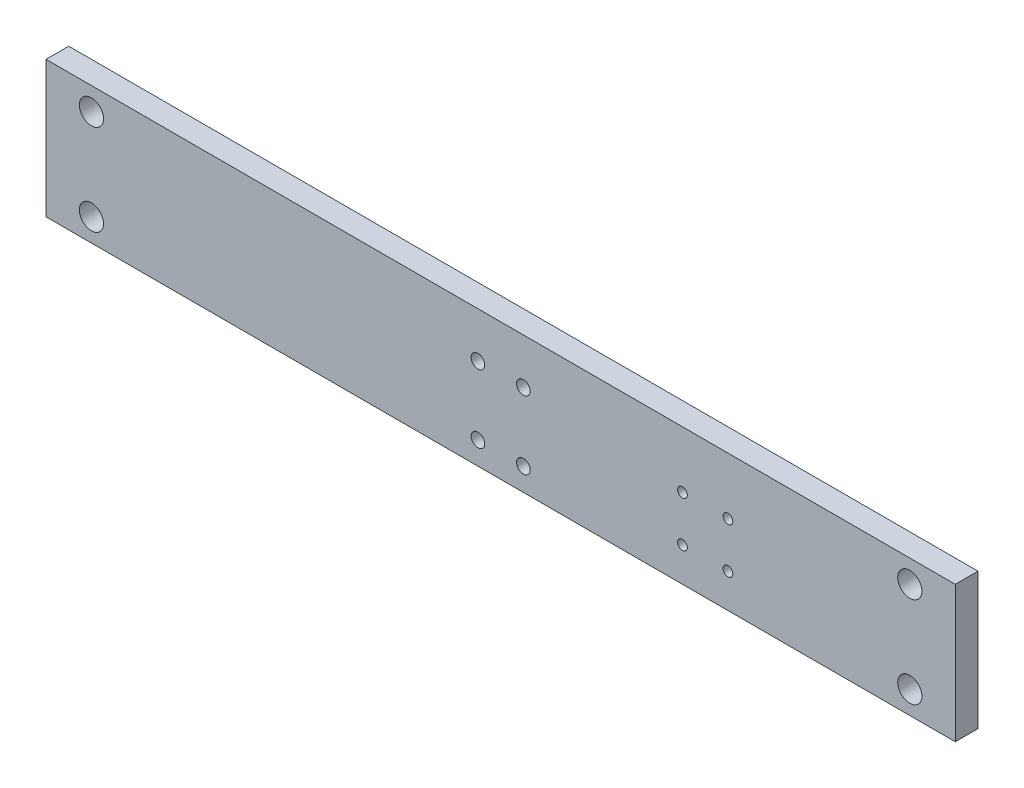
ISO-10303-21;
HEADER;
FILE_DESCRIPTION(('STEP AP214'),'2;1');
FILE_NAME('part.step','',(''),(''),'','','');
FILE_SCHEMA(('AUTOMOTIVE_DESIGN { 1 0 10303 214 1 1 1 1 }'));
ENDSEC;
DATA;
#1=APPLICATION_CONTEXT('core data for automotive mechanical design processes');
#2=APPLICATION_PROTOCOL_DEFINITION('international standard','automotive_design',2000,#1);
#3=PRODUCT_CONTEXT('',#1,'mechanical');
#4=PRODUCT('Part','Part','',(#3));
#5=PRODUCT_RELATED_PRODUCT_CATEGORY('part','',(#4));
#6=PRODUCT_DEFINITION_FORMATION('','',#4);
#7=PRODUCT_DEFINITION_CONTEXT('part definition',#1,'design');
#8=PRODUCT_DEFINITION('design','',#6,#7);
#9=PRODUCT_DEFINITION_SHAPE('','',#8);
#10=(LENGTH_UNIT() NAMED_UNIT(*) SI_UNIT(.MILLI.,.METRE.));
#11=(NAMED_UNIT(*) PLANE_ANGLE_UNIT() SI_UNIT($,.RADIAN.));
#12=(NAMED_UNIT(*) SI_UNIT($,.STERADIAN.) SOLID_ANGLE_UNIT());
#13=UNCERTAINTY_MEASURE_WITH_UNIT(LENGTH_MEASURE(1.E-05),#10,'distance_accuracy_value','');
#14=(GEOMETRIC_REPRESENTATION_CONTEXT(3) GLOBAL_UNCERTAINTY_ASSIGNED_CONTEXT((#13)) GLOBAL_UNIT_ASSIGNED_CONTEXT((#10,
#11,#12)) REPRESENTATION_CONTEXT('',''));
#15=CARTESIAN_POINT('',(0.,0.,0.));
#16=DIRECTION('',(0.,0.,1.));
#17=DIRECTION('',(1.,0.,0.));
#18=AXIS2_PLACEMENT_3D('',#15,#16,#17);
#19=CARTESIAN_POINT('',(-127.,-19.05,6.35));
#20=DIRECTION('',(0.,0.,1.));
#21=DIRECTION('',(1.,0.,0.));
#22=AXIS2_PLACEMENT_3D('',#19,#20,#21);
#23=PLANE('',#22);
#24=CARTESIAN_POINT('',(50.8,-9.52500000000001,6.34999999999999));
#25=DIRECTION('',(0.,0.,-1.));
#26=DIRECTION('',(-1.,0.,0.));
#27=AXIS2_PLACEMENT_3D('',#24,#25,#26);
#28=CIRCLE('',#27,1.35254999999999);
#29=CARTESIAN_POINT('',(49.44745,-9.52500000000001,6.34999999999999));
#30=VERTEX_POINT('',#29);
#31=EDGE_CURVE('E135',#30,#30,#28,.T.);
#32=ORIENTED_EDGE('',*,*,#31,.T.);
#33=EDGE_LOOP('',(#32));
#34=FACE_BOUND('',#33,.T.);
#35=CARTESIAN_POINT('',(63.5,3.17499999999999,6.34999999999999));
#36=DIRECTION('',(0.,0.,-1.));
#37=DIRECTION('',(-1.,0.,0.));
#38=AXIS2_PLACEMENT_3D('',#35,#36,#37);
#39=CIRCLE('',#38,1.35254999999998);
#40=CARTESIAN_POINT('',(62.14745,3.17499999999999,6.34999999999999));
#41=VERTEX_POINT('',#40);
#42=EDGE_CURVE('E147',#41,#41,#39,.T.);
#43=ORIENTED_EDGE('',*,*,#42,.T.);
#44=EDGE_LOOP('',(#43));
#45=FACE_BOUND('',#44,.T.);
#46=CARTESIAN_POINT('',(-114.3,12.7,6.35));
#47=DIRECTION('',(0.,0.,1.));
#48=DIRECTION('',(1.,0.,0.));
#49=AXIS2_PLACEMENT_3D('',#46,#47,#48);
#50=CIRCLE('',#49,3.37819999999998);
#51=CARTESIAN_POINT('',(-110.9218,12.7,6.35));
#52=VERTEX_POINT('',#51);
#53=EDGE_CURVE('E153',#52,#52,#50,.T.);
#54=ORIENTED_EDGE('',*,*,#53,.F.);
#55=EDGE_LOOP('',(#54));
#56=FACE_BOUND('',#55,.T.);
#57=CARTESIAN_POINT('',(-114.3,-12.7,6.35));
#58=DIRECTION('',(0.,0.,1.));
#59=DIRECTION('',(1.,0.,0.));
#60=AXIS2_PLACEMENT_3D('',#57,#58,#59);
#61=CIRCLE('',#60,3.37819999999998);
#62=CARTESIAN_POINT('',(-110.9218,-12.7,6.35));
#63=VERTEX_POINT('',#62);
#64=EDGE_CURVE('E159',#63,#63,#61,.T.);
#65=ORIENTED_EDGE('',*,*,#64,.F.);
#66=EDGE_LOOP('',(#65));
#67=FACE_BOUND('',#66,.T.);
#68=CARTESIAN_POINT('',(114.3,-12.7,6.35));
#69=DIRECTION('',(0.,0.,1.));
#70=DIRECTION('',(1.,0.,0.));
#71=AXIS2_PLACEMENT_3D('',#68,#69,#70);
#72=CIRCLE('',#71,3.37819999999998);
#73=CARTESIAN_POINT('',(117.6782,-12.7,6.35));
#74=VERTEX_POINT('',#73);
#75=EDGE_CURVE('E165',#74,#74,#72,.T.);
#76=ORIENTED_EDGE('',*,*,#75,.F.);
#77=EDGE_LOOP('',(#76));
#78=FACE_BOUND('',#77,.T.);
#79=CARTESIAN_POINT('',(114.3,12.7,6.35));
#80=DIRECTION('',(0.,0.,1.));
#81=DIRECTION('',(1.,0.,0.));
#82=AXIS2_PLACEMENT_3D('',#79,#80,#81);
#83=CIRCLE('',#82,3.37819999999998);
#84=CARTESIAN_POINT('',(117.6782,12.7,6.35));
#85=VERTEX_POINT('',#84);
#86=EDGE_CURVE('E171',#85,#85,#83,.T.);
#87=ORIENTED_EDGE('',*,*,#86,.F.);
#88=EDGE_LOOP('',(#87));
#89=FACE_BOUND('',#88,.T.);
#90=CARTESIAN_POINT('',(6.35,-12.7,6.35));
#91=DIRECTION('',(0.,0.,1.));
#92=DIRECTION('',(1.,0.,0.));
#93=AXIS2_PLACEMENT_3D('',#90,#91,#92);
#94=CIRCLE('',#93,1.89864999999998);
#95=CARTESIAN_POINT('',(8.24864999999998,-12.7,6.35));
#96=VERTEX_POINT('',#95);
#97=EDGE_CURVE('E180',#96,#96,#94,.T.);
#98=ORIENTED_EDGE('',*,*,#97,.F.);
#99=EDGE_LOOP('',(#98));
#100=FACE_BOUND('',#99,.T.);
#101=CARTESIAN_POINT('',(-6.35,-12.7,6.35));
#102=DIRECTION('',(0.,0.,1.));
#103=DIRECTION('',(1.,0.,0.));
#104=AXIS2_PLACEMENT_3D('',#101,#102,#103);
#105=CIRCLE('',#104,1.89864999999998);
#106=CARTESIAN_POINT('',(-4.45135000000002,-12.7,6.35));
#107=VERTEX_POINT('',#106);
#108=EDGE_CURVE('E186',#107,#107,#105,.T.);
#109=ORIENTED_EDGE('',*,*,#108,.F.);
#110=EDGE_LOOP('',(#109));
#111=FACE_BOUND('',#110,.T.);
#112=CARTESIAN_POINT('',(6.35,6.35,6.35));
#113=DIRECTION('',(0.,0.,1.));
#114=DIRECTION('',(1.,0.,0.));
#115=AXIS2_PLACEMENT_3D('',#112,#113,#114);
#116=CIRCLE('',#115,1.89864999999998);
#117=CARTESIAN_POINT('',(8.24864999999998,6.35,6.35));
#118=VERTEX_POINT('',#117);
#119=EDGE_CURVE('E192',#118,#118,#116,.T.);
#120=ORIENTED_EDGE('',*,*,#119,.F.);
#121=EDGE_LOOP('',(#120));
#122=FACE_BOUND('',#121,.T.);
#123=CARTESIAN_POINT('',(-6.35,6.35,6.35));
#124=DIRECTION('',(0.,0.,1.));
#125=DIRECTION('',(1.,0.,0.));
#126=AXIS2_PLACEMENT_3D('',#123,#124,#125);
#127=CIRCLE('',#126,1.89864999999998);
#128=CARTESIAN_POINT('',(-4.45135000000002,6.35,6.35));
#129=VERTEX_POINT('',#128);
#130=EDGE_CURVE('E98',#129,#129,#127,.T.);
#131=ORIENTED_EDGE('',*,*,#130,.F.);
#132=EDGE_LOOP('',(#131));
#133=FACE_BOUND('',#132,.T.);
#134=DIRECTION('',(0.,-1.,0.));
#135=VECTOR('',#134,1.);
#136=CARTESIAN_POINT('',(-127.,19.05,6.35));
#137=LINE('',#136,#135);
#138=CARTESIAN_POINT('',(-127.,19.05,6.35));
#139=VERTEX_POINT('',#138);
#140=CARTESIAN_POINT('',(-127.,-19.05,6.35));
#141=VERTEX_POINT('',#140);
#142=EDGE_CURVE('E108',#139,#141,#137,.T.);
#143=ORIENTED_EDGE('',*,*,#142,.T.);
#144=DIRECTION('',(1.,0.,0.));
#145=VECTOR('',#144,1.);
#146=CARTESIAN_POINT('',(-127.,-19.05,6.35));
#147=LINE('',#146,#145);
#148=CARTESIAN_POINT('',(127.,-19.05,6.35));
#149=VERTEX_POINT('',#148);
#150=EDGE_CURVE('E93',#141,#149,#147,.T.);
#151=ORIENTED_EDGE('',*,*,#150,.T.);
#152=DIRECTION('',(0.,1.,0.));
#153=VECTOR('',#152,1.);
#154=CARTESIAN_POINT('',(127.,19.05,6.35));
#155=LINE('',#154,#153);
#156=CARTESIAN_POINT('',(127.,19.05,6.35));
#157=VERTEX_POINT('',#156);
#158=EDGE_CURVE('E60',#149,#157,#155,.T.);
#159=ORIENTED_EDGE('',*,*,#158,.T.);
#160=DIRECTION('',(-1.,0.,0.));
#161=VECTOR('',#160,1.);
#162=CARTESIAN_POINT('',(-127.,19.05,6.35));
#163=LINE('',#162,#161);
#164=EDGE_CURVE('E55',#157,#139,#163,.T.);
#165=ORIENTED_EDGE('',*,*,#164,.T.);
#166=EDGE_LOOP('',(#143,#151,#159,#165));
#167=FACE_BOUND('',#166,.T.);
#168=CARTESIAN_POINT('',(63.5,-9.52500000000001,6.34999999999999));
#169=DIRECTION('',(0.,0.,-1.));
#170=DIRECTION('',(-1.,0.,0.));
#171=AXIS2_PLACEMENT_3D('',#168,#169,#170);
#172=CIRCLE('',#171,1.35254999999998);
#173=CARTESIAN_POINT('',(62.14745,-9.52500000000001,6.34999999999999));
#174=VERTEX_POINT('',#173);
#175=EDGE_CURVE('E127',#174,#174,#172,.T.);
#176=ORIENTED_EDGE('',*,*,#175,.T.);
#177=EDGE_LOOP('',(#176));
#178=FACE_BOUND('',#177,.T.);
#179=CARTESIAN_POINT('',(50.8,3.17499999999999,6.34999999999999));
#180=DIRECTION('',(0.,0.,-1.));
#181=DIRECTION('',(-1.,0.,0.));
#182=AXIS2_PLACEMENT_3D('',#179,#180,#181);
#183=CIRCLE('',#182,1.35254999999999);
#184=CARTESIAN_POINT('',(49.44745,3.17499999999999,6.34999999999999));
#185=VERTEX_POINT('',#184);
#186=EDGE_CURVE('E130',#185,#185,#183,.T.);
#187=ORIENTED_EDGE('',*,*,#186,.T.);
#188=EDGE_LOOP('',(#187));
#189=FACE_BOUND('',#188,.T.);
#190=ADVANCED_FACE('F40',(#34,#45,#56,#67,#78,#89,#100,#111,#122,#133,#167,#178,#189),#23,.T.);
#191=CARTESIAN_POINT('',(-127.,19.05,6.35));
#192=DIRECTION('',(1.,0.,0.));
#193=DIRECTION('',(0.,1.,0.));
#194=AXIS2_PLACEMENT_3D('',#191,#192,#193);
#195=PLANE('',#194);
#196=DIRECTION('',(0.,-1.,0.));
#197=VECTOR('',#196,1.);
#198=CARTESIAN_POINT('',(-127.,19.05,0.));
#199=LINE('',#198,#197);
#200=CARTESIAN_POINT('',(-127.,19.05,0.));
#201=VERTEX_POINT('',#200);
#202=CARTESIAN_POINT('',(-127.,-19.05,0.));
#203=VERTEX_POINT('',#202);
#204=EDGE_CURVE('E85',#201,#203,#199,.T.);
#205=ORIENTED_EDGE('',*,*,#204,.T.);
#206=DIRECTION('',(0.,0.,-1.));
#207=VECTOR('',#206,1.);
#208=CARTESIAN_POINT('',(-127.,-19.05,6.35));
#209=LINE('',#208,#207);
#210=EDGE_CURVE('E13',#141,#203,#209,.T.);
#211=ORIENTED_EDGE('',*,*,#210,.F.);
#212=ORIENTED_EDGE('',*,*,#142,.F.);
#213=DIRECTION('',(0.,0.,-1.));
#214=VECTOR('',#213,1.);
#215=CARTESIAN_POINT('',(-127.,19.05,6.35));
#216=LINE('',#215,#214);
#217=EDGE_CURVE('E97',#139,#201,#216,.T.);
#218=ORIENTED_EDGE('',*,*,#217,.T.);
#219=EDGE_LOOP('',(#205,#211,#212,#218));
#220=FACE_BOUND('',#219,.T.);
#221=ADVANCED_FACE('F42',(#220),#195,.F.);
#222=CARTESIAN_POINT('',(-127.,-19.05,6.35));
#223=DIRECTION('',(0.,1.,0.));
#224=DIRECTION('',(0.,0.,1.));
#225=AXIS2_PLACEMENT_3D('',#222,#223,#224);
#226=PLANE('',#225);
#227=DIRECTION('',(1.,0.,0.));
#228=VECTOR('',#227,1.);
#229=CARTESIAN_POINT('',(-127.,-19.05,0.));
#230=LINE('',#229,#228);
#231=CARTESIAN_POINT('',(127.,-19.05,0.));
#232=VERTEX_POINT('',#231);
#233=EDGE_CURVE('E81',#203,#232,#230,.T.);
#234=ORIENTED_EDGE('',*,*,#233,.T.);
#235=DIRECTION('',(0.,0.,-1.));
#236=VECTOR('',#235,1.);
#237=CARTESIAN_POINT('',(127.,-19.05,6.35));
#238=LINE('',#237,#236);
#239=EDGE_CURVE('E48',#149,#232,#238,.T.);
#240=ORIENTED_EDGE('',*,*,#239,.F.);
#241=ORIENTED_EDGE('',*,*,#150,.F.);
#242=ORIENTED_EDGE('',*,*,#210,.T.);
#243=EDGE_LOOP('',(#234,#240,#241,#242));
#244=FACE_BOUND('',#243,.T.);
#245=ADVANCED_FACE('F92',(#244),#226,.F.);
#246=CARTESIAN_POINT('',(127.,19.05,6.35));
#247=DIRECTION('',(-1.,0.,0.));
#248=DIRECTION('',(0.,0.,1.));
#249=AXIS2_PLACEMENT_3D('',#246,#247,#248);
#250=PLANE('',#249);
#251=DIRECTION('',(0.,1.,0.));
#252=VECTOR('',#251,1.);
#253=CARTESIAN_POINT('',(127.,19.05,0.));
#254=LINE('',#253,#252);
#255=CARTESIAN_POINT('',(127.,19.05,0.));
#256=VERTEX_POINT('',#255);
#257=EDGE_CURVE('E86',#232,#256,#254,.T.);
#258=ORIENTED_EDGE('',*,*,#257,.T.);
#259=DIRECTION('',(0.,0.,-1.));
#260=VECTOR('',#259,1.);
#261=CARTESIAN_POINT('',(127.,19.05,6.35));
#262=LINE('',#261,#260);
#263=EDGE_CURVE('E114',#157,#256,#262,.T.);
#264=ORIENTED_EDGE('',*,*,#263,.F.);
#265=ORIENTED_EDGE('',*,*,#158,.F.);
#266=ORIENTED_EDGE('',*,*,#239,.T.);
#267=EDGE_LOOP('',(#258,#264,#265,#266));
#268=FACE_BOUND('',#267,.T.);
#269=ADVANCED_FACE('F117',(#268),#250,.F.);
#270=CARTESIAN_POINT('',(-127.,19.05,6.35));
#271=DIRECTION('',(0.,-1.,0.));
#272=DIRECTION('',(0.,0.,-1.));
#273=AXIS2_PLACEMENT_3D('',#270,#271,#272);
#274=PLANE('',#273);
#275=DIRECTION('',(-1.,0.,0.));
#276=VECTOR('',#275,1.);
#277=CARTESIAN_POINT('',(-127.,19.05,0.));
#278=LINE('',#277,#276);
#279=EDGE_CURVE('E106',#256,#201,#278,.T.);
#280=ORIENTED_EDGE('',*,*,#279,.T.);
#281=ORIENTED_EDGE('',*,*,#217,.F.);
#282=ORIENTED_EDGE('',*,*,#164,.F.);
#283=ORIENTED_EDGE('',*,*,#263,.T.);
#284=EDGE_LOOP('',(#280,#281,#282,#283));
#285=FACE_BOUND('',#284,.T.);
#286=ADVANCED_FACE('F119',(#285),#274,.F.);
#287=CARTESIAN_POINT('',(-127.,-19.05,0.));
#288=DIRECTION('',(0.,0.,1.));
#289=DIRECTION('',(1.,0.,0.));
#290=AXIS2_PLACEMENT_3D('',#287,#288,#289);
#291=PLANE('',#290);
#292=CARTESIAN_POINT('',(50.8,3.17499999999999,0.));
#293=DIRECTION('',(0.,0.,-1.));
#294=DIRECTION('',(-1.,0.,0.));
#295=AXIS2_PLACEMENT_3D('',#292,#293,#294);
#296=CIRCLE('',#295,1.35254999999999);
#297=CARTESIAN_POINT('',(49.44745,3.17499999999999,0.));
#298=VERTEX_POINT('',#297);
#299=EDGE_CURVE('E132',#298,#298,#296,.T.);
#300=ORIENTED_EDGE('',*,*,#299,.F.);
#301=EDGE_LOOP('',(#300));
#302=FACE_BOUND('',#301,.T.);
#303=CARTESIAN_POINT('',(50.8,-9.52500000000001,0.));
#304=DIRECTION('',(0.,0.,-1.));
#305=DIRECTION('',(-1.,0.,0.));
#306=AXIS2_PLACEMENT_3D('',#303,#304,#305);
#307=CIRCLE('',#306,1.35254999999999);
#308=CARTESIAN_POINT('',(49.44745,-9.52500000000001,0.));
#309=VERTEX_POINT('',#308);
#310=EDGE_CURVE('E140',#309,#309,#307,.T.);
#311=ORIENTED_EDGE('',*,*,#310,.F.);
#312=EDGE_LOOP('',(#311));
#313=FACE_BOUND('',#312,.T.);
#314=CARTESIAN_POINT('',(63.5,-9.52500000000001,0.));
#315=DIRECTION('',(0.,0.,-1.));
#316=DIRECTION('',(-1.,0.,0.));
#317=AXIS2_PLACEMENT_3D('',#314,#315,#316);
#318=CIRCLE('',#317,1.35254999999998);
#319=CARTESIAN_POINT('',(62.14745,-9.52500000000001,0.));
#320=VERTEX_POINT('',#319);
#321=EDGE_CURVE('E144',#320,#320,#318,.T.);
#322=ORIENTED_EDGE('',*,*,#321,.F.);
#323=EDGE_LOOP('',(#322));
#324=FACE_BOUND('',#323,.T.);
#325=CARTESIAN_POINT('',(63.5,3.17499999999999,0.));
#326=DIRECTION('',(0.,0.,-1.));
#327=DIRECTION('',(-1.,0.,0.));
#328=AXIS2_PLACEMENT_3D('',#325,#326,#327);
#329=CIRCLE('',#328,1.35254999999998);
#330=CARTESIAN_POINT('',(62.14745,3.17499999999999,0.));
#331=VERTEX_POINT('',#330);
#332=EDGE_CURVE('E150',#331,#331,#329,.T.);
#333=ORIENTED_EDGE('',*,*,#332,.F.);
#334=EDGE_LOOP('',(#333));
#335=FACE_BOUND('',#334,.T.);
#336=CARTESIAN_POINT('',(-114.3,12.7,0.));
#337=DIRECTION('',(0.,0.,1.));
#338=DIRECTION('',(1.,0.,0.));
#339=AXIS2_PLACEMENT_3D('',#336,#337,#338);
#340=CIRCLE('',#339,3.3782);
#341=CARTESIAN_POINT('',(-110.9218,12.7,0.));
#342=VERTEX_POINT('',#341);
#343=EDGE_CURVE('E156',#342,#342,#340,.T.);
#344=ORIENTED_EDGE('',*,*,#343,.T.);
#345=EDGE_LOOP('',(#344));
#346=FACE_BOUND('',#345,.T.);
#347=CARTESIAN_POINT('',(-114.3,-12.7,0.));
#348=DIRECTION('',(0.,0.,1.));
#349=DIRECTION('',(1.,0.,0.));
#350=AXIS2_PLACEMENT_3D('',#347,#348,#349);
#351=CIRCLE('',#350,3.3782);
#352=CARTESIAN_POINT('',(-110.9218,-12.7,0.));
#353=VERTEX_POINT('',#352);
#354=EDGE_CURVE('E162',#353,#353,#351,.T.);
#355=ORIENTED_EDGE('',*,*,#354,.T.);
#356=EDGE_LOOP('',(#355));
#357=FACE_BOUND('',#356,.T.);
#358=CARTESIAN_POINT('',(114.3,-12.7,0.));
#359=DIRECTION('',(0.,0.,1.));
#360=DIRECTION('',(1.,0.,0.));
#361=AXIS2_PLACEMENT_3D('',#358,#359,#360);
#362=CIRCLE('',#361,3.3782);
#363=CARTESIAN_POINT('',(117.6782,-12.7,0.));
#364=VERTEX_POINT('',#363);
#365=EDGE_CURVE('E168',#364,#364,#362,.T.);
#366=ORIENTED_EDGE('',*,*,#365,.T.);
#367=EDGE_LOOP('',(#366));
#368=FACE_BOUND('',#367,.T.);
#369=CARTESIAN_POINT('',(114.3,12.7,0.));
#370=DIRECTION('',(0.,0.,1.));
#371=DIRECTION('',(1.,0.,0.));
#372=AXIS2_PLACEMENT_3D('',#369,#370,#371);
#373=CIRCLE('',#372,3.3782);
#374=CARTESIAN_POINT('',(117.6782,12.7,0.));
#375=VERTEX_POINT('',#374);
#376=EDGE_CURVE('E174',#375,#375,#373,.T.);
#377=ORIENTED_EDGE('',*,*,#376,.T.);
#378=EDGE_LOOP('',(#377));
#379=FACE_BOUND('',#378,.T.);
#380=CARTESIAN_POINT('',(6.35,-12.7,0.));
#381=DIRECTION('',(0.,0.,-1.));
#382=DIRECTION('',(-1.,0.,0.));
#383=AXIS2_PLACEMENT_3D('',#380,#381,#382);
#384=CIRCLE('',#383,1.89864999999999);
#385=CARTESIAN_POINT('',(4.45135000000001,-12.7,0.));
#386=VERTEX_POINT('',#385);
#387=EDGE_CURVE('E177',#386,#386,#384,.T.);
#388=ORIENTED_EDGE('',*,*,#387,.F.);
#389=EDGE_LOOP('',(#388));
#390=FACE_BOUND('',#389,.T.);
#391=CARTESIAN_POINT('',(-6.35,-12.7,0.));
#392=DIRECTION('',(0.,0.,-1.));
#393=DIRECTION('',(-1.,0.,0.));
#394=AXIS2_PLACEMENT_3D('',#391,#392,#393);
#395=CIRCLE('',#394,1.89864999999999);
#396=CARTESIAN_POINT('',(-8.24864999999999,-12.7,0.));
#397=VERTEX_POINT('',#396);
#398=EDGE_CURVE('E183',#397,#397,#395,.T.);
#399=ORIENTED_EDGE('',*,*,#398,.F.);
#400=EDGE_LOOP('',(#399));
#401=FACE_BOUND('',#400,.T.);
#402=CARTESIAN_POINT('',(6.35,6.35,0.));
#403=DIRECTION('',(0.,0.,-1.));
#404=DIRECTION('',(-1.,0.,0.));
#405=AXIS2_PLACEMENT_3D('',#402,#403,#404);
#406=CIRCLE('',#405,1.89864999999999);
#407=CARTESIAN_POINT('',(4.45135000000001,6.35,0.));
#408=VERTEX_POINT('',#407);
#409=EDGE_CURVE('E189',#408,#408,#406,.T.);
#410=ORIENTED_EDGE('',*,*,#409,.F.);
#411=EDGE_LOOP('',(#410));
#412=FACE_BOUND('',#411,.T.);
#413=CARTESIAN_POINT('',(-6.35,6.35,0.));
#414=DIRECTION('',(0.,0.,-1.));
#415=DIRECTION('',(-1.,0.,0.));
#416=AXIS2_PLACEMENT_3D('',#413,#414,#415);
#417=CIRCLE('',#416,1.89864999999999);
#418=CARTESIAN_POINT('',(-8.24864999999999,6.35,0.));
#419=VERTEX_POINT('',#418);
#420=EDGE_CURVE('E101',#419,#419,#417,.T.);
#421=ORIENTED_EDGE('',*,*,#420,.F.);
#422=EDGE_LOOP('',(#421));
#423=FACE_BOUND('',#422,.T.);
#424=ORIENTED_EDGE('',*,*,#204,.F.);
#425=ORIENTED_EDGE('',*,*,#279,.F.);
#426=ORIENTED_EDGE('',*,*,#257,.F.);
#427=ORIENTED_EDGE('',*,*,#233,.F.);
#428=EDGE_LOOP('',(#424,#425,#426,#427));
#429=FACE_BOUND('',#428,.T.);
#430=ADVANCED_FACE('F82',(#302,#313,#324,#335,#346,#357,#368,#379,#390,#401,#412,#423,#429),
#291,.F.);
#431=CARTESIAN_POINT('',(-6.35,6.35,0.));
#432=DIRECTION('',(0.,0.,-1.));
#433=DIRECTION('',(-1.,0.,0.));
#434=AXIS2_PLACEMENT_3D('',#431,#432,#433);
#435=CYLINDRICAL_SURFACE('',#434,1.89864999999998);
#436=ORIENTED_EDGE('',*,*,#130,.T.);
#437=EDGE_LOOP('',(#436));
#438=FACE_BOUND('',#437,.T.);
#439=ORIENTED_EDGE('',*,*,#420,.T.);
#440=EDGE_LOOP('',(#439));
#441=FACE_BOUND('',#440,.T.);
#442=ADVANCED_FACE('F197',(#438,#441),#435,.F.);
#443=CARTESIAN_POINT('',(6.35,6.35,0.));
#444=DIRECTION('',(0.,0.,-1.));
#445=DIRECTION('',(-1.,0.,0.));
#446=AXIS2_PLACEMENT_3D('',#443,#444,#445);
#447=CYLINDRICAL_SURFACE('',#446,1.89864999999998);
#448=ORIENTED_EDGE('',*,*,#119,.T.);
#449=EDGE_LOOP('',(#448));
#450=FACE_BOUND('',#449,.T.);
#451=ORIENTED_EDGE('',*,*,#409,.T.);
#452=EDGE_LOOP('',(#451));
#453=FACE_BOUND('',#452,.T.);
#454=ADVANCED_FACE('F206',(#450,#453),#447,.F.);
#455=CARTESIAN_POINT('',(-6.35,-12.7,0.));
#456=DIRECTION('',(0.,0.,-1.));
#457=DIRECTION('',(-1.,0.,0.));
#458=AXIS2_PLACEMENT_3D('',#455,#456,#457);
#459=CYLINDRICAL_SURFACE('',#458,1.89864999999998);
#460=ORIENTED_EDGE('',*,*,#108,.T.);
#461=EDGE_LOOP('',(#460));
#462=FACE_BOUND('',#461,.T.);
#463=ORIENTED_EDGE('',*,*,#398,.T.);
#464=EDGE_LOOP('',(#463));
#465=FACE_BOUND('',#464,.T.);
#466=ADVANCED_FACE('F245',(#462,#465),#459,.F.);
#467=CARTESIAN_POINT('',(6.35,-12.7,0.));
#468=DIRECTION('',(0.,0.,-1.));
#469=DIRECTION('',(-1.,0.,0.));
#470=AXIS2_PLACEMENT_3D('',#467,#468,#469);
#471=CYLINDRICAL_SURFACE('',#470,1.89864999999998);
#472=ORIENTED_EDGE('',*,*,#97,.T.);
#473=EDGE_LOOP('',(#472));
#474=FACE_BOUND('',#473,.T.);
#475=ORIENTED_EDGE('',*,*,#387,.T.);
#476=EDGE_LOOP('',(#475));
#477=FACE_BOUND('',#476,.T.);
#478=ADVANCED_FACE('F252',(#474,#477),#471,.F.);
#479=CARTESIAN_POINT('',(114.3,12.7,6.35));
#480=DIRECTION('',(0.,0.,1.));
#481=DIRECTION('',(1.,0.,0.));
#482=AXIS2_PLACEMENT_3D('',#479,#480,#481);
#483=CYLINDRICAL_SURFACE('',#482,3.37819999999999);
#484=ORIENTED_EDGE('',*,*,#376,.F.);
#485=EDGE_LOOP('',(#484));
#486=FACE_BOUND('',#485,.T.);
#487=ORIENTED_EDGE('',*,*,#86,.T.);
#488=EDGE_LOOP('',(#487));
#489=FACE_BOUND('',#488,.T.);
#490=ADVANCED_FACE('F260',(#486,#489),#483,.F.);
#491=CARTESIAN_POINT('',(114.3,-12.7,6.35));
#492=DIRECTION('',(0.,0.,1.));
#493=DIRECTION('',(1.,0.,0.));
#494=AXIS2_PLACEMENT_3D('',#491,#492,#493);
#495=CYLINDRICAL_SURFACE('',#494,3.37819999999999);
#496=ORIENTED_EDGE('',*,*,#365,.F.);
#497=EDGE_LOOP('',(#496));
#498=FACE_BOUND('',#497,.T.);
#499=ORIENTED_EDGE('',*,*,#75,.T.);
#500=EDGE_LOOP('',(#499));
#501=FACE_BOUND('',#500,.T.);
#502=ADVANCED_FACE('F268',(#498,#501),#495,.F.);
#503=CARTESIAN_POINT('',(-114.3,-12.7,6.35));
#504=DIRECTION('',(0.,0.,1.));
#505=DIRECTION('',(1.,0.,0.));
#506=AXIS2_PLACEMENT_3D('',#503,#504,#505);
#507=CYLINDRICAL_SURFACE('',#506,3.37819999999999);
#508=ORIENTED_EDGE('',*,*,#354,.F.);
#509=EDGE_LOOP('',(#508));
#510=FACE_BOUND('',#509,.T.);
#511=ORIENTED_EDGE('',*,*,#64,.T.);
#512=EDGE_LOOP('',(#511));
#513=FACE_BOUND('',#512,.T.);
#514=ADVANCED_FACE('F276',(#510,#513),#507,.F.);
#515=CARTESIAN_POINT('',(-114.3,12.7,6.35));
#516=DIRECTION('',(0.,0.,1.));
#517=DIRECTION('',(1.,0.,0.));
#518=AXIS2_PLACEMENT_3D('',#515,#516,#517);
#519=CYLINDRICAL_SURFACE('',#518,3.37819999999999);
#520=ORIENTED_EDGE('',*,*,#343,.F.);
#521=EDGE_LOOP('',(#520));
#522=FACE_BOUND('',#521,.T.);
#523=ORIENTED_EDGE('',*,*,#53,.T.);
#524=EDGE_LOOP('',(#523));
#525=FACE_BOUND('',#524,.T.);
#526=ADVANCED_FACE('F284',(#522,#525),#519,.F.);
#527=CARTESIAN_POINT('',(63.5,3.17499999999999,0.));
#528=DIRECTION('',(0.,0.,-1.));
#529=DIRECTION('',(-1.,0.,0.));
#530=AXIS2_PLACEMENT_3D('',#527,#528,#529);
#531=CYLINDRICAL_SURFACE('',#530,1.35254999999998);
#532=ORIENTED_EDGE('',*,*,#42,.F.);
#533=EDGE_LOOP('',(#532));
#534=FACE_BOUND('',#533,.T.);
#535=ORIENTED_EDGE('',*,*,#332,.T.);
#536=EDGE_LOOP('',(#535));
#537=FACE_BOUND('',#536,.T.);
#538=ADVANCED_FACE('F292',(#534,#537),#531,.F.);
#539=CARTESIAN_POINT('',(63.5,-9.52500000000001,0.));
#540=DIRECTION('',(0.,0.,-1.));
#541=DIRECTION('',(-1.,0.,0.));
#542=AXIS2_PLACEMENT_3D('',#539,#540,#541);
#543=CYLINDRICAL_SURFACE('',#542,1.35254999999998);
#544=ORIENTED_EDGE('',*,*,#175,.F.);
#545=EDGE_LOOP('',(#544));
#546=FACE_BOUND('',#545,.T.);
#547=ORIENTED_EDGE('',*,*,#321,.T.);
#548=EDGE_LOOP('',(#547));
#549=FACE_BOUND('',#548,.T.);
#550=ADVANCED_FACE('F303',(#546,#549),#543,.F.);
#551=CARTESIAN_POINT('',(50.8,-9.52500000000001,0.));
#552=DIRECTION('',(0.,0.,-1.));
#553=DIRECTION('',(-1.,0.,0.));
#554=AXIS2_PLACEMENT_3D('',#551,#552,#553);
#555=CYLINDRICAL_SURFACE('',#554,1.35254999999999);
#556=ORIENTED_EDGE('',*,*,#31,.F.);
#557=EDGE_LOOP('',(#556));
#558=FACE_BOUND('',#557,.T.);
#559=ORIENTED_EDGE('',*,*,#310,.T.);
#560=EDGE_LOOP('',(#559));
#561=FACE_BOUND('',#560,.T.);
#562=ADVANCED_FACE('F311',(#558,#561),#555,.F.);
#563=CARTESIAN_POINT('',(50.8,3.17499999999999,0.));
#564=DIRECTION('',(0.,0.,-1.));
#565=DIRECTION('',(-1.,0.,0.));
#566=AXIS2_PLACEMENT_3D('',#563,#564,#565);
#567=CYLINDRICAL_SURFACE('',#566,1.35254999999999);
#568=ORIENTED_EDGE('',*,*,#186,.F.);
#569=EDGE_LOOP('',(#568));
#570=FACE_BOUND('',#569,.T.);
#571=ORIENTED_EDGE('',*,*,#299,.T.);
#572=EDGE_LOOP('',(#571));
#573=FACE_BOUND('',#572,.T.);
#574=ADVANCED_FACE('F319',(#570,#573),#567,.F.);
#575=CLOSED_SHELL('',(#190,#221,#245,#269,#286,#430,#442,#454,#466,#478,#490,#502,#514,#526,
#538,#550,#562,#574));
#576=MANIFOLD_SOLID_BREP('B2',#575);
#577=ADVANCED_BREP_SHAPE_REPRESENTATION('',(#18,#576),#14);
#578=SHAPE_DEFINITION_REPRESENTATION(#9,#577);
ENDSEC;
END-ISO-10303-21;
